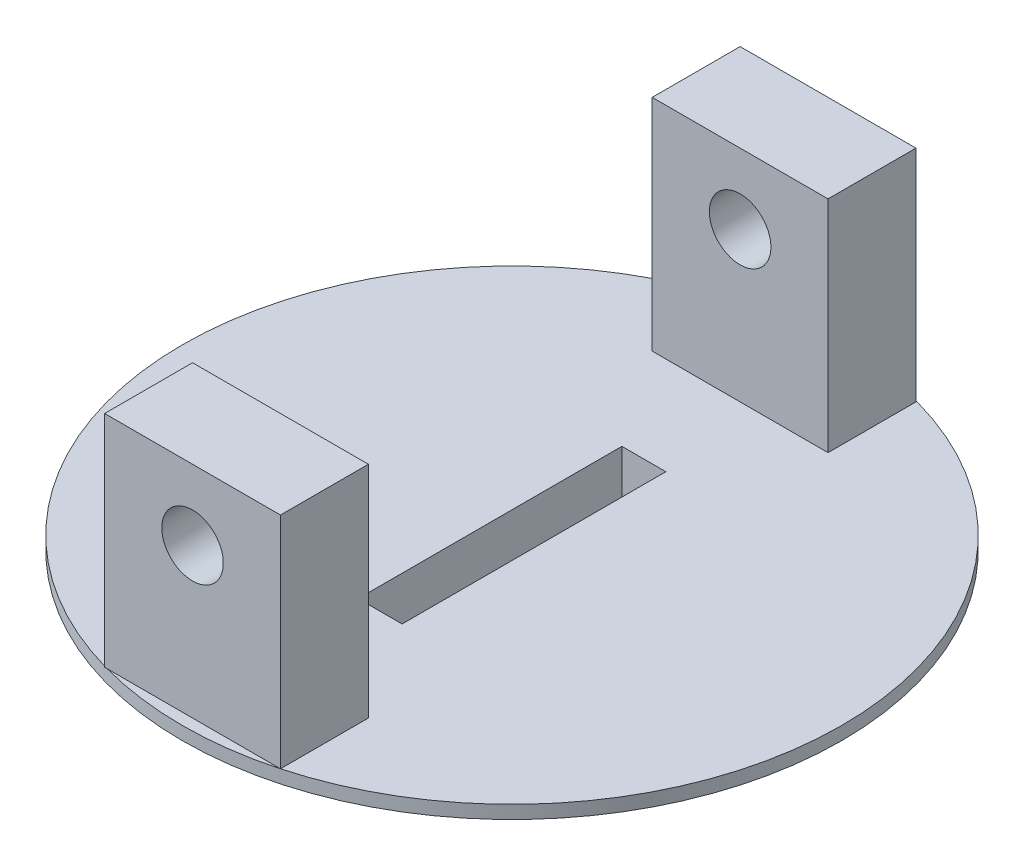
from build123d import *

# Parameters (mm, degrees)
ESQUISSE1_R             = 37.5
BOSS_EXTRU_1_DEPTH      = 1.5
ESQUISSE2_R             = 17.5
BOSS_EXTRU_2_DEPTH      = 8
ESQUISSE4_W             = 20
ESQUISSE4_H             = 72.283474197
BOSS_EXTRU_5_DEPTH      = 25
ESQUISSE11_W            = 52.283474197
ESQUISSE11_H            = 25
ENL_V_MAT_EXTRU_5_DEPTH = 25
ESQUISSE12_R            = 3.5
ENL_V_MAT_EXTRU_8_DEPTH = 87.749161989
ESQUISSE13_W            = 5
ESQUISSE13_H            = 30
ENL_V_MAT_EXTRU_9_DEPTH = 12


with BuildPart() as part:
    # Esquisse1 → Boss.-Extru.1 (new body)
    with BuildSketch(Plane(origin=(0, 0, 0), x_dir=(1, 0, 0), z_dir=(0, 1, 0))):
        with Locations(Location((0, 0, 0), (0, 0, 270))):
            Circle(ESQUISSE1_R)
    extrude(amount=BOSS_EXTRU_1_DEPTH)

    # Esquisse2 → Boss.-Extru.2 (add)
    with BuildSketch(Plane(origin=(0, 1.5, 0), x_dir=(1, 0, 0), z_dir=(0, 1, 0))):
        with Locations(Location((0, 0, 0), (0, 0, 270))):
            Circle(ESQUISSE2_R)
    extrude(amount=-BOSS_EXTRU_2_DEPTH)

    # Esquisse4 → Boss.-Extru.5 (add)
    with BuildSketch(Plane(origin=(0, 1.5, 0), x_dir=(1, 0, 0), z_dir=(0, 1, 0))):
        with Locations((-0.151898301, -0.042028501)):
            Rectangle(ESQUISSE4_W, ESQUISSE4_H)
    extrude(amount=BOSS_EXTRU_5_DEPTH)

    # Esquisse11 → Enl_v. mat.-Extru.5 (cut)
    with BuildSketch(Plane(origin=(9.848101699, 0, 0), x_dir=(0, 0, -1), z_dir=(1, 0, 0))):
        with Locations((-0.0420285, 14)):
            Rectangle(ESQUISSE11_W, ESQUISSE11_H)
    extrude(amount=-ENL_V_MAT_EXTRU_5_DEPTH, mode=Mode.SUBTRACT)

    # Esquisse12 → Enl_v. mat.-Extru.8 (cut, through all)
    with BuildSketch(Plane(origin=(0, 0, -36.099708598), x_dir=(-1, 0, 0), z_dir=(0, 0, -1))):
        with Locations((0.151898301, 18.5)):
            Circle(ESQUISSE12_R)
    extrude(amount=-ENL_V_MAT_EXTRU_8_DEPTH, mode=Mode.SUBTRACT)

    # Esquisse13 → Enl_v. mat.-Extru.9 (cut)
    with BuildSketch(Plane(origin=(0, 1.5, 0), x_dir=(1, 0, 0), z_dir=(0, 1, 0))):
        Rectangle(ESQUISSE13_W, ESQUISSE13_H)
    extrude(amount=-ENL_V_MAT_EXTRU_9_DEPTH, mode=Mode.SUBTRACT)


solid = part.part
